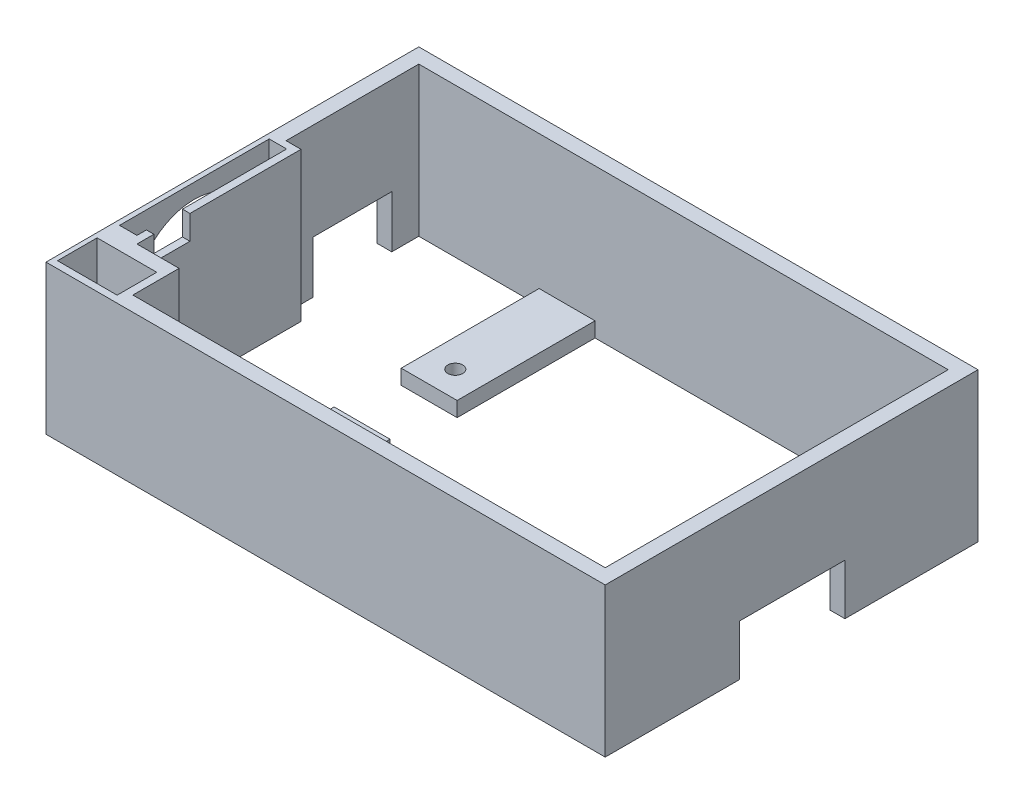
from build123d import *

# Parameters (mm, degrees)
SKETCH1_W           = 150
SKETCH1_H           = 100
SKETCH1_W_2         = 142
SKETCH1_H_2         = 92
BOSS_EXTRUDE1_DEPTH = 40
SKETCH11_W          = 2
SKETCH11_H          = 40
BOSS_EXTRUDE5_DEPTH = 4
SKETCH12_W          = 2
SKETCH12_H          = 40
BOSS_EXTRUDE6_DEPTH = 42
SKETCH13_W          = 4.68
SKETCH13_H          = 40.15
CUT_EXTRUDE4_DEPTH  = 40
SKETCH10_R          = 16
CUT_EXTRUDE5_DEPTH  = 42
SKETCH15_W          = 21.1
SKETCH15_H          = 14
CUT_EXTRUDE6_DEPTH  = 10
SKETCH14_W          = 15
SKETCH14_H          = 37
SKETCH14_R          = 2
BOSS_EXTRUDE7_DEPTH = 4
SKETCH16_W          = 28.256368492
SKETCH16_H          = 13.604289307
CUT_EXTRUDE7_DEPTH  = 4
SKETCH17_W          = 15.3
SKETCH17_H          = 12.399420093
BOSS_EXTRUDE8_DEPTH = 40
SKETCH18_W          = 16
SKETCH18_H          = 10.63
CUT_EXTRUDE8_DEPTH  = 20
SKETCH19_W          = 4.910866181
SKETCH19_H          = 10
CUT_EXTRUDE9_DEPTH  = 20
SKETCH20_W          = 9.670628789
SKETCH20_H          = 6.46432359
CUT_EXTRUDE10_DEPTH = 4


with BuildPart() as part:
    # Sketch1 → Boss-Extrude1 (new body)
    with BuildSketch(Plane(origin=(0, 0, 0), x_dir=(1, 0, 0), z_dir=(0, 1, 0))):
        with Locations((75, 50)):
            Rectangle(SKETCH1_W, SKETCH1_H)
        with Locations((75, 50)):
            Rectangle(SKETCH1_W_2, SKETCH1_H_2, mode=Mode.SUBTRACT)
    extrude(amount=BOSS_EXTRUDE1_DEPTH)

    # Sketch11 → Boss-Extrude5 (add)
    with BuildSketch(Plane(origin=(4, 0, 0), x_dir=(0, 0, -1), z_dir=(1, 0, 0))):
        with Locations((17.399420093, 20)):
            Rectangle(SKETCH11_W, SKETCH11_H)
        with Locations((59.399420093, 20)):
            Rectangle(SKETCH11_W, SKETCH11_H)
    extrude(amount=BOSS_EXTRUDE5_DEPTH)

    # Sketch12 → Boss-Extrude6 (add)
    with BuildSketch(Plane(origin=(0, 0, -18.399420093), x_dir=(-1, 0, 0), z_dir=(0, 0, -1))):
        with Locations((-7, 20)):
            Rectangle(SKETCH12_W, SKETCH12_H)
    extrude(amount=BOSS_EXTRUDE6_DEPTH)

    # Sketch13 → Cut-Extrude4 (cut)
    with BuildSketch(Plane(origin=(0, 40, 0), x_dir=(1, 0, 0), z_dir=(0, 1, 0))):
        with Locations((3.66, 38.474420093)):
            Rectangle(SKETCH13_W, SKETCH13_H)
    extrude(amount=-CUT_EXTRUDE4_DEPTH, mode=Mode.SUBTRACT)

    # Sketch10 → Cut-Extrude5 (cut)
    with BuildSketch(Plane(origin=(4, 0, 0), x_dir=(0, 0, -1), z_dir=(1, 0, 0))):
        with Locations((38.399420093, 20)):
            Circle(SKETCH10_R)
    extrude(amount=-CUT_EXTRUDE5_DEPTH, mode=Mode.SUBTRACT)

    # Sketch15 → Cut-Extrude6 (cut)
    with BuildSketch(Plane(origin=(4, 0, 0), x_dir=(0, 0, -1), z_dir=(1, 0, 0))):
        with Locations((78.2, 7)):
            Rectangle(SKETCH15_W, SKETCH15_H)
    extrude(amount=-CUT_EXTRUDE6_DEPTH, mode=Mode.SUBTRACT)

    # Sketch14 → Boss-Extrude7 (add)
    # profile 1 of 4: a face of its own
    with BuildSketch(Plane(origin=(0, 0, 0), x_dir=(-1, 0, 0), z_dir=(0, -1, 0))):
        with Locations((-43.77898907, 22.5)):
            Rectangle(SKETCH14_W, SKETCH14_H)
        with Locations(Location((-43.77898907, 34, 0), (0, 0, 90))):
            Circle(SKETCH14_R, mode=Mode.SUBTRACT)
    # profile 2 of 4: a face of its own
    with BuildSketch(Plane(origin=(0, 0, 0), x_dir=(-1, 0, 0), z_dir=(0, -1, 0))):
        with Locations((-43.77898907, 77.5)):
            Rectangle(SKETCH14_W, SKETCH14_H)
        with Locations(Location((-43.77898907, 66, 0), (0, 0, 90))):
            Circle(SKETCH14_R, mode=Mode.SUBTRACT)
    # profile 3 of 4: a face of its own
    with BuildSketch(Plane(origin=(0, 0, 0), x_dir=(-1, 0, 0), z_dir=(0, -1, 0))):
        with Locations((-120.039769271, 77.5)):
            Rectangle(SKETCH14_W, SKETCH14_H)
        with Locations(Location((-120.039769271, 65.243070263, 0), (0, 0, 90))):
            Circle(SKETCH14_R, mode=Mode.SUBTRACT)
    # profile 4 of 4: a face of its own
    with BuildSketch(Plane(origin=(0, 0, 0), x_dir=(-1, 0, 0), z_dir=(0, -1, 0))):
        with Locations((-120.039769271, 22.5)):
            Rectangle(SKETCH14_W, SKETCH14_H)
        with Locations(Location((-120.039769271, 34, 0), (0, 0, 90))):
            Circle(SKETCH14_R, mode=Mode.SUBTRACT)
    extrude(amount=-BOSS_EXTRUDE7_DEPTH)

    # Sketch16 → Cut-Extrude7 (cut)
    with BuildSketch(Plane(origin=(150, 0, 0), x_dir=(0, 0, -1), z_dir=(1, 0, 0))):
        with Locations((50.176287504, 6.802144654)):
            Rectangle(SKETCH16_W, SKETCH16_H)
    extrude(amount=-CUT_EXTRUDE7_DEPTH, mode=Mode.SUBTRACT)

    # Sketch17 → Boss-Extrude8 (add)
    with BuildSketch(Plane(origin=(0, 40, 0), x_dir=(1, 0, 0), z_dir=(0, 1, 0))):
        with Locations((11.65, 10.199710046)):
            Rectangle(SKETCH17_W, SKETCH17_H)
    extrude(amount=-BOSS_EXTRUDE8_DEPTH)

    # Sketch18 → Cut-Extrude8 (cut)
    with BuildSketch(Plane(origin=(0, 40, 0), x_dir=(1, 0, 0), z_dir=(0, 1, 0))):
        with Locations((9.22, 7.177604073)):
            Rectangle(SKETCH18_W, SKETCH18_H)
    extrude(amount=-CUT_EXTRUDE8_DEPTH, mode=Mode.SUBTRACT)

    # Sketch19 → Cut-Extrude9 (cut)
    with BuildSketch(Plane.XY.offset(-12.492604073)):
        with Locations((13.689724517, 25)):
            Rectangle(SKETCH19_W, SKETCH19_H)
    extrude(amount=-CUT_EXTRUDE9_DEPTH, mode=Mode.SUBTRACT)

    # Sketch20 → Cut-Extrude10 (cut)
    with BuildSketch(Plane(origin=(8, 0, 0), x_dir=(0, 0, -1), z_dir=(1, 0, 0))):
        with Locations((25.773060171, 36.767838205)):
            Rectangle(SKETCH20_W, SKETCH20_H)
    extrude(amount=-CUT_EXTRUDE10_DEPTH, mode=Mode.SUBTRACT)


solid = part.part
